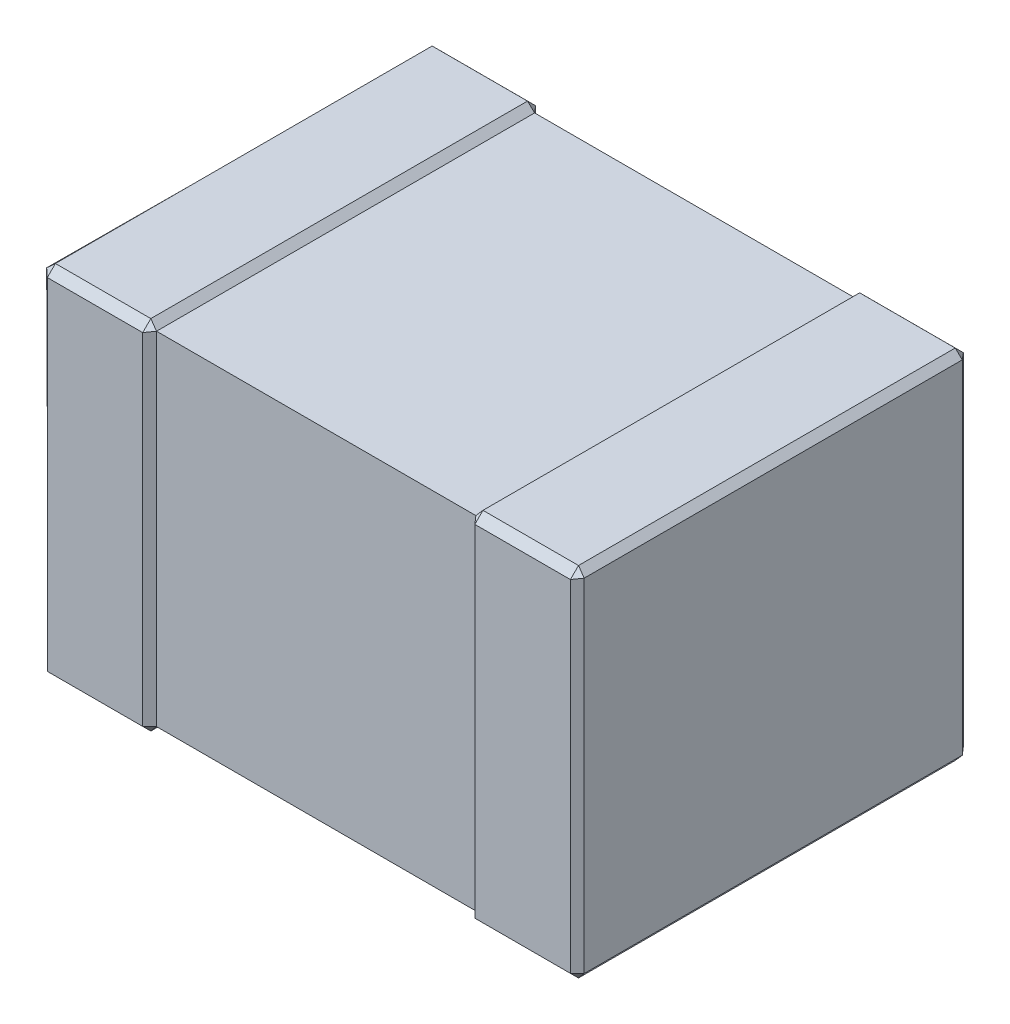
ISO-10303-21;
HEADER;
FILE_DESCRIPTION(('STEP AP214'),'2;1');
FILE_NAME('part.step','',(''),(''),'','','');
FILE_SCHEMA(('AUTOMOTIVE_DESIGN { 1 0 10303 214 1 1 1 1 }'));
ENDSEC;
DATA;
#1=APPLICATION_CONTEXT('core data for automotive mechanical design processes');
#2=APPLICATION_PROTOCOL_DEFINITION('international standard','automotive_design',2000,#1);
#3=PRODUCT_CONTEXT('',#1,'mechanical');
#4=PRODUCT('Part','Part','',(#3));
#5=PRODUCT_RELATED_PRODUCT_CATEGORY('part','',(#4));
#6=PRODUCT_DEFINITION_FORMATION('','',#4);
#7=PRODUCT_DEFINITION_CONTEXT('part definition',#1,'design');
#8=PRODUCT_DEFINITION('design','',#6,#7);
#9=PRODUCT_DEFINITION_SHAPE('','',#8);
#10=(LENGTH_UNIT() NAMED_UNIT(*) SI_UNIT(.MILLI.,.METRE.));
#11=(NAMED_UNIT(*) PLANE_ANGLE_UNIT() SI_UNIT($,.RADIAN.));
#12=(NAMED_UNIT(*) SI_UNIT($,.STERADIAN.) SOLID_ANGLE_UNIT());
#13=UNCERTAINTY_MEASURE_WITH_UNIT(LENGTH_MEASURE(1.E-05),#10,'distance_accuracy_value','');
#14=(GEOMETRIC_REPRESENTATION_CONTEXT(3) GLOBAL_UNCERTAINTY_ASSIGNED_CONTEXT((#13)) GLOBAL_UNIT_ASSIGNED_CONTEXT((#10,
#11,#12)) REPRESENTATION_CONTEXT('',''));
#15=CARTESIAN_POINT('',(0.,0.,0.));
#16=DIRECTION('',(0.,0.,1.));
#17=DIRECTION('',(1.,0.,0.));
#18=AXIS2_PLACEMENT_3D('',#15,#16,#17);
#19=CARTESIAN_POINT('',(1.912500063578,1.210036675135,2.786660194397));
#20=DIRECTION('',(-1.,0.,0.));
#21=DIRECTION('',(0.,0.,1.));
#22=AXIS2_PLACEMENT_3D('',#19,#20,#21);
#23=PLANE('',#22);
#24=CARTESIAN_POINT('',(1.912500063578,-1.210036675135,0.112191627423));
#25=DIRECTION('',(0.,1.,0.));
#26=VECTOR('',#25,1.);
#27=LINE('',#24,#26);
#28=CARTESIAN_POINT('',(1.91250006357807,-1.22210232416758,0.10006981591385));
#29=VERTEX_POINT('',#28);
#30=CARTESIAN_POINT('',(1.9125000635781,1.22210232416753,0.100069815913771));
#31=VERTEX_POINT('',#30);
#32=EDGE_CURVE('E205',#29,#31,#27,.T.);
#33=ORIENTED_EDGE('',*,*,#32,.T.);
#34=CARTESIAN_POINT('',(1.91250006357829,1.23416797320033,2.81090386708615));
#35=DIRECTION('',(0.,0.,-1.));
#36=VECTOR('',#35,1.);
#37=LINE('',#34,#36);
#38=CARTESIAN_POINT('',(1.91250006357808,1.22210232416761,2.79878203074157));
#39=VERTEX_POINT('',#38);
#40=EDGE_CURVE('E213',#39,#31,#37,.T.);
#41=ORIENTED_EDGE('',*,*,#40,.F.);
#42=CARTESIAN_POINT('',(1.912500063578,-1.2341679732,2.810903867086));
#43=DIRECTION('',(0.,1.,0.));
#44=VECTOR('',#43,1.);
#45=LINE('',#42,#44);
#46=CARTESIAN_POINT('',(1.91250006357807,-1.2221023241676,2.79878203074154));
#47=VERTEX_POINT('',#46);
#48=EDGE_CURVE('E218',#47,#39,#45,.T.);
#49=ORIENTED_EDGE('',*,*,#48,.F.);
#50=CARTESIAN_POINT('',(1.912500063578,-1.210036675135,2.786660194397));
#51=DIRECTION('',(0.,0.,-1.));
#52=VECTOR('',#51,1.);
#53=LINE('',#50,#52);
#54=EDGE_CURVE('E182',#47,#29,#53,.T.);
#55=ORIENTED_EDGE('',*,*,#54,.T.);
#56=EDGE_LOOP('',(#33,#41,#49,#55));
#57=FACE_BOUND('',#56,.T.);
#58=ADVANCED_FACE('F17',(#57),#23,.F.);
#59=CARTESIAN_POINT('',(1.878444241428,-1.264640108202,1.46938790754));
#60=DIRECTION('',(0.666808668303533,-0.745228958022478,0.));
#61=DIRECTION('',(0.745228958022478,0.666808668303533,0.));
#62=AXIS2_PLACEMENT_3D('',#59,#60,#61);
#63=PLANE('',#62);
#64=DIRECTION('',(0.,0.,1.));
#65=VECTOR('',#64,1.);
#66=CARTESIAN_POINT('',(1.86686595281,-1.275000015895,0.104939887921));
#67=LINE('',#66,#65);
#68=CARTESIAN_POINT('',(1.86686595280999,-1.27500001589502,2.79391193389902));
#69=VERTEX_POINT('',#68);
#70=CARTESIAN_POINT('',(1.86686595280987,-1.27500001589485,0.104939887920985));
#71=VERTEX_POINT('',#70);
#72=EDGE_CURVE('E186',#69,#71,#67,.F.);
#73=ORIENTED_EDGE('',*,*,#72,.T.);
#74=DIRECTION('',(-0.718095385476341,-0.642530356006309,0.267383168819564));
#75=VECTOR('',#74,1.);
#76=CARTESIAN_POINT('',(1.91250006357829,-1.23416797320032,0.0879480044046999));
#77=LINE('',#76,#75);
#78=EDGE_CURVE('E177',#29,#71,#77,.T.);
#79=ORIENTED_EDGE('',*,*,#78,.F.);
#80=ORIENTED_EDGE('',*,*,#54,.F.);
#81=DIRECTION('',(-0.718095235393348,-0.642530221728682,-0.267383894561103));
#82=VECTOR('',#81,1.);
#83=CARTESIAN_POINT('',(1.91250006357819,-1.23416797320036,2.81090386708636));
#84=LINE('',#83,#82);
#85=EDGE_CURVE('E212',#47,#69,#84,.T.);
#86=ORIENTED_EDGE('',*,*,#85,.T.);
#87=EDGE_LOOP('',(#73,#79,#80,#86));
#88=FACE_BOUND('',#87,.T.);
#89=ADVANCED_FACE('F179',(#88),#63,.T.);
#90=CARTESIAN_POINT('',(1.912500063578,1.2341679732,2.810903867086));
#91=DIRECTION('',(-0.668525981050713,0.,-0.743688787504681));
#92=DIRECTION('',(-0.743688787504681,0.,0.668525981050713));
#93=AXIS2_PLACEMENT_3D('',#90,#91,#92);
#94=PLANE('',#93);
#95=DIRECTION('',(0.,1.,0.));
#96=VECTOR('',#95,1.);
#97=CARTESIAN_POINT('',(1.86686595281,1.217254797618,2.851925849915));
#98=LINE('',#97,#96);
#99=CARTESIAN_POINT('',(1.86686595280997,1.21725479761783,2.85192584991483));
#100=VERTEX_POINT('',#99);
#101=CARTESIAN_POINT('',(1.86686595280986,-1.21725479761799,2.85192584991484));
#102=VERTEX_POINT('',#101);
#103=EDGE_CURVE('E559',#100,#102,#98,.F.);
#104=ORIENTED_EDGE('',*,*,#103,.T.);
#105=DIRECTION('',(0.716953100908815,-0.265721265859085,-0.644492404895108));
#106=VECTOR('',#105,1.);
#107=CARTESIAN_POINT('',(1.86686595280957,-1.217254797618,2.85192584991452));
#108=LINE('',#107,#106);
#109=EDGE_CURVE('E191',#102,#47,#108,.T.);
#110=ORIENTED_EDGE('',*,*,#109,.T.);
#111=ORIENTED_EDGE('',*,*,#48,.T.);
#112=DIRECTION('',(-0.716953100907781,-0.26572126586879,0.644492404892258));
#113=VECTOR('',#112,1.);
#114=CARTESIAN_POINT('',(1.91250006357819,1.23416797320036,2.81090386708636));
#115=LINE('',#114,#113);
#116=EDGE_CURVE('E542',#39,#100,#115,.T.);
#117=ORIENTED_EDGE('',*,*,#116,.T.);
#118=EDGE_LOOP('',(#104,#110,#111,#117));
#119=FACE_BOUND('',#118,.T.);
#120=ADVANCED_FACE('F239',(#119),#94,.F.);
#121=CARTESIAN_POINT('',(1.880749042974,-1.242482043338,2.819270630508));
#122=DIRECTION('',(-0.348232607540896,0.664384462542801,-0.661307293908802));
#123=DIRECTION('',(0.,0.705463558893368,0.708746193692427));
#124=AXIS2_PLACEMENT_3D('',#121,#122,#123);
#125=PLANE('',#124);
#126=DIRECTION('',(0.,-0.705463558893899,-0.708746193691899));
#127=VECTOR('',#126,1.);
#128=CARTESIAN_POINT('',(1.86686595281,-1.232554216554,2.836555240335));
#129=LINE('',#128,#127);
#130=EDGE_CURVE('E568',#69,#102,#129,.F.);
#131=ORIENTED_EDGE('',*,*,#130,.F.);
#132=ORIENTED_EDGE('',*,*,#85,.F.);
#133=ORIENTED_EDGE('',*,*,#109,.F.);
#134=EDGE_LOOP('',(#131,#132,#133));
#135=FACE_BOUND('',#134,.T.);
#136=ADVANCED_FACE('F243',(#135),#125,.F.);
#137=CARTESIAN_POINT('',(1.912500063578,1.2341679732,0.0879480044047));
#138=DIRECTION('',(-0.348233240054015,-0.664384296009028,0.661307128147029));
#139=DIRECTION('',(0.,-0.705463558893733,-0.708746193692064));
#140=AXIS2_PLACEMENT_3D('',#137,#138,#139);
#141=PLANE('',#140);
#142=DIRECTION('',(0.,-0.705463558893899,-0.708746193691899));
#143=VECTOR('',#142,1.);
#144=CARTESIAN_POINT('',(1.86686595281,1.275000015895,0.104939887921));
#145=LINE('',#144,#143);
#146=CARTESIAN_POINT('',(1.86686595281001,1.217254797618,0.0469259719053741));
#147=VERTEX_POINT('',#146);
#148=CARTESIAN_POINT('',(1.86686595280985,1.27500001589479,0.10493988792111));
#149=VERTEX_POINT('',#148);
#150=EDGE_CURVE('E573',#147,#149,#145,.F.);
#151=ORIENTED_EDGE('',*,*,#150,.T.);
#152=DIRECTION('',(-0.718095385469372,0.642530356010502,0.267383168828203));
#153=VECTOR('',#152,1.);
#154=CARTESIAN_POINT('',(1.912500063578,1.2341679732,0.0879480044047));
#155=LINE('',#154,#153);
#156=EDGE_CURVE('E538',#31,#149,#155,.T.);
#157=ORIENTED_EDGE('',*,*,#156,.F.);
#158=DIRECTION('',(0.716952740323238,0.265721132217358,0.644492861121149));
#159=VECTOR('',#158,1.);
#160=CARTESIAN_POINT('',(1.86686595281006,1.217254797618,0.046925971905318));
#161=LINE('',#160,#159);
#162=EDGE_CURVE('E200',#147,#31,#161,.T.);
#163=ORIENTED_EDGE('',*,*,#162,.F.);
#164=EDGE_LOOP('',(#151,#157,#163));
#165=FACE_BOUND('',#164,.T.);
#166=ADVANCED_FACE('F270',(#165),#141,.F.);
#167=CARTESIAN_POINT('',(1.878444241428,1.264640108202,1.46938790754));
#168=DIRECTION('',(-0.666808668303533,-0.745228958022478,0.));
#169=DIRECTION('',(0.745228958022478,-0.666808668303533,0.));
#170=AXIS2_PLACEMENT_3D('',#167,#168,#169);
#171=PLANE('',#170);
#172=DIRECTION('',(0.,0.,-1.));
#173=VECTOR('',#172,1.);
#174=CARTESIAN_POINT('',(1.86686595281,1.275000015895,0.104939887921));
#175=LINE('',#174,#173);
#176=CARTESIAN_POINT('',(1.86686595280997,1.27500001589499,2.79391193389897));
#177=VERTEX_POINT('',#176);
#178=EDGE_CURVE('E580',#149,#177,#175,.F.);
#179=ORIENTED_EDGE('',*,*,#178,.T.);
#180=DIRECTION('',(0.718095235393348,-0.642530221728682,0.267383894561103));
#181=VECTOR('',#180,1.);
#182=CARTESIAN_POINT('',(1.86686595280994,1.27500001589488,2.79391193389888));
#183=LINE('',#182,#181);
#184=EDGE_CURVE('E201',#177,#39,#183,.T.);
#185=ORIENTED_EDGE('',*,*,#184,.T.);
#186=ORIENTED_EDGE('',*,*,#40,.T.);
#187=ORIENTED_EDGE('',*,*,#156,.T.);
#188=EDGE_LOOP('',(#179,#185,#186,#187));
#189=FACE_BOUND('',#188,.T.);
#190=ADVANCED_FACE('F260',(#189),#171,.F.);
#191=CARTESIAN_POINT('',(1.880749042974,1.242482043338,2.819270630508));
#192=DIRECTION('',(-0.348232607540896,-0.664384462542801,-0.661307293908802));
#193=DIRECTION('',(0.,0.705463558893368,-0.708746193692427));
#194=AXIS2_PLACEMENT_3D('',#191,#192,#193);
#195=PLANE('',#194);
#196=DIRECTION('',(0.,0.705463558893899,-0.708746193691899));
#197=VECTOR('',#196,1.);
#198=CARTESIAN_POINT('',(1.86686595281,1.275000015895,2.793911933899));
#199=LINE('',#198,#197);
#200=EDGE_CURVE('E583',#177,#100,#199,.F.);
#201=ORIENTED_EDGE('',*,*,#200,.T.);
#202=ORIENTED_EDGE('',*,*,#116,.F.);
#203=ORIENTED_EDGE('',*,*,#184,.F.);
#204=EDGE_LOOP('',(#201,#202,#203));
#205=FACE_BOUND('',#204,.T.);
#206=ADVANCED_FACE('F269',(#205),#195,.F.);
#207=CARTESIAN_POINT('',(1.912500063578,-1.2341679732,0.0879480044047));
#208=DIRECTION('',(-0.348233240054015,0.664384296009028,0.661307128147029));
#209=DIRECTION('',(0.,-0.705463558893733,0.708746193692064));
#210=AXIS2_PLACEMENT_3D('',#207,#208,#209);
#211=PLANE('',#210);
#212=DIRECTION('',(0.,0.705463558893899,-0.708746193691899));
#213=VECTOR('',#212,1.);
#214=CARTESIAN_POINT('',(1.86686595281,-1.232554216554,0.0622965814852));
#215=LINE('',#214,#213);
#216=CARTESIAN_POINT('',(1.86686595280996,-1.2172547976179,0.0469259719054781));
#217=VERTEX_POINT('',#216);
#218=EDGE_CURVE('E196',#217,#71,#215,.F.);
#219=ORIENTED_EDGE('',*,*,#218,.F.);
#220=DIRECTION('',(-0.716952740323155,0.265721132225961,-0.644492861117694));
#221=VECTOR('',#220,1.);
#222=CARTESIAN_POINT('',(1.912500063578,-1.2341679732,0.0879480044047));
#223=LINE('',#222,#221);
#224=EDGE_CURVE('E193',#29,#217,#223,.T.);
#225=ORIENTED_EDGE('',*,*,#224,.F.);
#226=ORIENTED_EDGE('',*,*,#78,.T.);
#227=EDGE_LOOP('',(#219,#225,#226));
#228=FACE_BOUND('',#227,.T.);
#229=ADVANCED_FACE('F195',(#228),#211,.F.);
#230=CARTESIAN_POINT('',(1.878461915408,0.01994885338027,0.05734997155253));
#231=DIRECTION('',(0.66852642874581,0.,-0.743688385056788));
#232=DIRECTION('',(-0.743688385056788,0.,-0.66852642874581));
#233=AXIS2_PLACEMENT_3D('',#230,#231,#232);
#234=PLANE('',#233);
#235=DIRECTION('',(0.,1.,0.));
#236=VECTOR('',#235,1.);
#237=CARTESIAN_POINT('',(1.86686595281,-1.217254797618,0.04692597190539));
#238=LINE('',#237,#236);
#239=EDGE_CURVE('E602',#217,#147,#238,.T.);
#240=ORIENTED_EDGE('',*,*,#239,.T.);
#241=ORIENTED_EDGE('',*,*,#162,.T.);
#242=ORIENTED_EDGE('',*,*,#32,.F.);
#243=ORIENTED_EDGE('',*,*,#224,.T.);
#244=EDGE_LOOP('',(#240,#241,#242,#243));
#245=FACE_BOUND('',#244,.T.);
#246=ADVANCED_FACE('F207',(#245),#234,.T.);
#247=CARTESIAN_POINT('',(1.184772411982,1.275000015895,2.793911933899));
#248=DIRECTION('',(0.,-0.708746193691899,-0.705463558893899));
#249=DIRECTION('',(0.,0.705463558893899,-0.708746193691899));
#250=AXIS2_PLACEMENT_3D('',#247,#248,#249);
#251=PLANE('',#250);
#252=DIRECTION('',(1.,0.,0.));
#253=VECTOR('',#252,1.);
#254=CARTESIAN_POINT('',(1.184772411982,1.2172547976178,2.8519258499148));
#255=LINE('',#254,#253);
#256=CARTESIAN_POINT('',(1.18477241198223,1.21725479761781,2.85192584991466));
#257=VERTEX_POINT('',#256);
#258=EDGE_CURVE('E592',#100,#257,#255,.F.);
#259=ORIENTED_EDGE('',*,*,#258,.F.);
#260=ORIENTED_EDGE('',*,*,#200,.F.);
#261=DIRECTION('',(1.,0.,0.));
#262=VECTOR('',#261,1.);
#263=CARTESIAN_POINT('',(1.184772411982,1.275000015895,2.793911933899));
#264=LINE('',#263,#262);
#265=CARTESIAN_POINT('',(1.18477241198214,1.2750000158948,2.79391193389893));
#266=VERTEX_POINT('',#265);
#267=EDGE_CURVE('E613',#177,#266,#264,.F.);
#268=ORIENTED_EDGE('',*,*,#267,.T.);
#269=DIRECTION('',(0.,-0.705463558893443,0.708746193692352));
#270=VECTOR('',#269,1.);
#271=CARTESIAN_POINT('',(1.18477241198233,1.24613729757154,2.82290895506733));
#272=LINE('',#271,#270);
#273=EDGE_CURVE('E618',#257,#266,#272,.F.);
#274=ORIENTED_EDGE('',*,*,#273,.F.);
#275=EDGE_LOOP('',(#259,#260,#268,#274));
#276=FACE_BOUND('',#275,.T.);
#277=ADVANCED_FACE('F753',(#276),#251,.F.);
#278=CARTESIAN_POINT('',(1.86686595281,-1.275000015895,0.104939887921));
#279=DIRECTION('',(0.,1.,0.));
#280=DIRECTION('',(0.,0.,1.));
#281=AXIS2_PLACEMENT_3D('',#278,#279,#280);
#282=PLANE('',#281);
#283=DIRECTION('',(0.,0.,1.));
#284=VECTOR('',#283,1.);
#285=CARTESIAN_POINT('',(1.18477241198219,-1.27500001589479,1.469387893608));
#286=LINE('',#285,#284);
#287=CARTESIAN_POINT('',(1.18477241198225,-1.27500001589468,0.104939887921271));
#288=VERTEX_POINT('',#287);
#289=CARTESIAN_POINT('',(1.18477241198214,-1.27500001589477,2.79391193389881));
#290=VERTEX_POINT('',#289);
#291=EDGE_CURVE('E631',#288,#290,#286,.T.);
#292=ORIENTED_EDGE('',*,*,#291,.F.);
#293=DIRECTION('',(1.,0.,0.));
#294=VECTOR('',#293,1.);
#295=CARTESIAN_POINT('',(1.506579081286,-1.27500001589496,0.104939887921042));
#296=LINE('',#295,#294);
#297=EDGE_CURVE('E622',#71,#288,#296,.F.);
#298=ORIENTED_EDGE('',*,*,#297,.F.);
#299=ORIENTED_EDGE('',*,*,#72,.F.);
#300=DIRECTION('',(1.,0.,0.));
#301=VECTOR('',#300,1.);
#302=CARTESIAN_POINT('',(1.86686595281,-1.275000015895,2.793911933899));
#303=LINE('',#302,#301);
#304=EDGE_CURVE('E555',#290,#69,#303,.T.);
#305=ORIENTED_EDGE('',*,*,#304,.F.);
#306=EDGE_LOOP('',(#292,#298,#299,#305));
#307=FACE_BOUND('',#306,.T.);
#308=ADVANCED_FACE('F749',(#307),#282,.F.);
#309=CARTESIAN_POINT('',(1.506579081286,-1.259700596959,2.809282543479));
#310=DIRECTION('',(0.,0.708746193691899,-0.705463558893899));
#311=DIRECTION('',(0.,0.705463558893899,0.708746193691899));
#312=AXIS2_PLACEMENT_3D('',#309,#310,#311);
#313=PLANE('',#312);
#314=ORIENTED_EDGE('',*,*,#304,.T.);
#315=ORIENTED_EDGE('',*,*,#130,.T.);
#316=DIRECTION('',(-1.,0.,0.));
#317=VECTOR('',#316,1.);
#318=CARTESIAN_POINT('',(1.184772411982,-1.217254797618,2.851925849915));
#319=LINE('',#318,#317);
#320=CARTESIAN_POINT('',(1.18477241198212,-1.21725479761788,2.85192584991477));
#321=VERTEX_POINT('',#320);
#322=EDGE_CURVE('E604',#102,#321,#319,.T.);
#323=ORIENTED_EDGE('',*,*,#322,.T.);
#324=DIRECTION('',(0.,-0.705463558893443,-0.708746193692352));
#325=VECTOR('',#324,1.);
#326=CARTESIAN_POINT('',(1.18477241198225,-1.24613729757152,2.82290895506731));
#327=LINE('',#326,#325);
#328=EDGE_CURVE('E639',#290,#321,#327,.F.);
#329=ORIENTED_EDGE('',*,*,#328,.F.);
#330=EDGE_LOOP('',(#314,#315,#323,#329));
#331=FACE_BOUND('',#330,.T.);
#332=ADVANCED_FACE('F745',(#331),#313,.F.);
#333=CARTESIAN_POINT('',(1.184772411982,1.217254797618,2.851925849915));
#334=DIRECTION('',(0.,0.,-1.));
#335=DIRECTION('',(-1.,0.,0.));
#336=AXIS2_PLACEMENT_3D('',#333,#334,#335);
#337=PLANE('',#336);
#338=ORIENTED_EDGE('',*,*,#322,.F.);
#339=ORIENTED_EDGE('',*,*,#103,.F.);
#340=ORIENTED_EDGE('',*,*,#258,.T.);
#341=DIRECTION('',(0.,1.,0.));
#342=VECTOR('',#341,1.);
#343=CARTESIAN_POINT('',(1.18477241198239,0.01994883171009,2.85192584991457));
#344=LINE('',#343,#342);
#345=EDGE_CURVE('E648',#257,#321,#344,.F.);
#346=ORIENTED_EDGE('',*,*,#345,.T.);
#347=EDGE_LOOP('',(#338,#339,#340,#346));
#348=FACE_BOUND('',#347,.T.);
#349=ADVANCED_FACE('F741',(#348),#337,.F.);
#350=CARTESIAN_POINT('',(1.506579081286,1.232554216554,0.0622965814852));
#351=DIRECTION('',(0.,0.708746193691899,-0.705463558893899));
#352=DIRECTION('',(0.,0.705463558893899,0.708746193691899));
#353=AXIS2_PLACEMENT_3D('',#350,#351,#352);
#354=PLANE('',#353);
#355=DIRECTION('',(1.,0.,0.));
#356=VECTOR('',#355,1.);
#357=CARTESIAN_POINT('',(1.184772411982,1.217254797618,0.04692597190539));
#358=LINE('',#357,#356);
#359=CARTESIAN_POINT('',(1.1847724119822,1.21725479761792,0.0469259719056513));
#360=VERTEX_POINT('',#359);
#361=EDGE_CURVE('E626',#147,#360,#358,.F.);
#362=ORIENTED_EDGE('',*,*,#361,.T.);
#363=DIRECTION('',(0.,-0.705463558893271,-0.708746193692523));
#364=VECTOR('',#363,1.);
#365=CARTESIAN_POINT('',(1.18477241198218,1.24618292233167,0.0759887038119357));
#366=LINE('',#365,#364);
#367=CARTESIAN_POINT('',(1.18477241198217,1.27500001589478,0.104939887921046));
#368=VERTEX_POINT('',#367);
#369=EDGE_CURVE('E651',#360,#368,#366,.F.);
#370=ORIENTED_EDGE('',*,*,#369,.T.);
#371=DIRECTION('',(1.,0.,0.));
#372=VECTOR('',#371,1.);
#373=CARTESIAN_POINT('',(1.184772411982,1.275000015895,0.104939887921));
#374=LINE('',#373,#372);
#375=EDGE_CURVE('E577',#368,#149,#374,.T.);
#376=ORIENTED_EDGE('',*,*,#375,.T.);
#377=ORIENTED_EDGE('',*,*,#150,.F.);
#378=EDGE_LOOP('',(#362,#370,#376,#377));
#379=FACE_BOUND('',#378,.T.);
#380=ADVANCED_FACE('F737',(#379),#354,.T.);
#381=CARTESIAN_POINT('',(1.184772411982,1.275000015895,0.104939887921));
#382=DIRECTION('',(0.,-1.,0.));
#383=DIRECTION('',(0.,0.,-1.));
#384=AXIS2_PLACEMENT_3D('',#381,#382,#383);
#385=PLANE('',#384);
#386=ORIENTED_EDGE('',*,*,#267,.F.);
#387=ORIENTED_EDGE('',*,*,#178,.F.);
#388=ORIENTED_EDGE('',*,*,#375,.F.);
#389=DIRECTION('',(0.,0.,1.));
#390=VECTOR('',#389,1.);
#391=CARTESIAN_POINT('',(1.18477241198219,1.27500001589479,1.469387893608));
#392=LINE('',#391,#390);
#393=EDGE_CURVE('E660',#368,#266,#392,.T.);
#394=ORIENTED_EDGE('',*,*,#393,.T.);
#395=EDGE_LOOP('',(#386,#387,#388,#394));
#396=FACE_BOUND('',#395,.T.);
#397=ADVANCED_FACE('F733',(#396),#385,.F.);
#398=CARTESIAN_POINT('',(1.17088935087,1.242482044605,2.819270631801));
#399=DIRECTION('',(-0.348233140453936,0.664384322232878,0.661307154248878));
#400=DIRECTION('',(0.,-0.705463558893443,0.708746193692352));
#401=AXIS2_PLACEMENT_3D('',#398,#399,#400);
#402=PLANE('',#401);
#403=ORIENTED_EDGE('',*,*,#273,.T.);
#404=DIRECTION('',(-0.718094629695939,-0.64253079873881,0.267384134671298));
#405=VECTOR('',#404,1.);
#406=CARTESIAN_POINT('',(1.18477241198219,1.27500001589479,2.793911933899));
#407=LINE('',#406,#405);
#408=CARTESIAN_POINT('',(1.13913838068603,1.22210232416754,2.79878203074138));
#409=VERTEX_POINT('',#408);
#410=EDGE_CURVE('E665',#266,#409,#407,.T.);
#411=ORIENTED_EDGE('',*,*,#410,.T.);
#412=DIRECTION('',(0.716952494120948,-0.265721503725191,0.644492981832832));
#413=VECTOR('',#412,1.);
#414=CARTESIAN_POINT('',(1.13913838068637,1.2341679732,2.81090386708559));
#415=LINE('',#414,#413);
#416=EDGE_CURVE('E641',#409,#257,#415,.T.);
#417=ORIENTED_EDGE('',*,*,#416,.T.);
#418=EDGE_LOOP('',(#403,#411,#417));
#419=FACE_BOUND('',#418,.T.);
#420=ADVANCED_FACE('F729',(#419),#402,.T.);
#421=CARTESIAN_POINT('',(1.506579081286,-1.259700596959,0.08956927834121));
#422=DIRECTION('',(0.,-0.708746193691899,-0.705463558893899));
#423=DIRECTION('',(0.,0.705463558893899,-0.708746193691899));
#424=AXIS2_PLACEMENT_3D('',#421,#422,#423);
#425=PLANE('',#424);
#426=ORIENTED_EDGE('',*,*,#297,.T.);
#427=DIRECTION('',(0.,-0.705463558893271,0.708746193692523));
#428=VECTOR('',#427,1.);
#429=CARTESIAN_POINT('',(1.1847724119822,-1.24618292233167,0.0759887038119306));
#430=LINE('',#429,#428);
#431=CARTESIAN_POINT('',(1.18477241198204,-1.21725479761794,0.0469259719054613));
#432=VERTEX_POINT('',#431);
#433=EDGE_CURVE('E670',#288,#432,#430,.F.);
#434=ORIENTED_EDGE('',*,*,#433,.T.);
#435=DIRECTION('',(1.,0.,0.));
#436=VECTOR('',#435,1.);
#437=CARTESIAN_POINT('',(1.184772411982,-1.217254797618,0.04692597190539));
#438=LINE('',#437,#436);
#439=EDGE_CURVE('E599',#432,#217,#438,.T.);
#440=ORIENTED_EDGE('',*,*,#439,.T.);
#441=ORIENTED_EDGE('',*,*,#218,.T.);
#442=EDGE_LOOP('',(#426,#434,#440,#441));
#443=FACE_BOUND('',#442,.T.);
#444=ADVANCED_FACE('F725',(#443),#425,.T.);
#445=CARTESIAN_POINT('',(1.184772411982,-1.217254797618,0.04692597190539));
#446=DIRECTION('',(0.,0.,1.));
#447=DIRECTION('',(1.,0.,0.));
#448=AXIS2_PLACEMENT_3D('',#445,#446,#447);
#449=PLANE('',#448);
#450=ORIENTED_EDGE('',*,*,#361,.F.);
#451=ORIENTED_EDGE('',*,*,#239,.F.);
#452=ORIENTED_EDGE('',*,*,#439,.F.);
#453=DIRECTION('',(0.,1.,0.));
#454=VECTOR('',#453,1.);
#455=CARTESIAN_POINT('',(1.18477241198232,0.01994883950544,0.0469259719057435));
#456=LINE('',#455,#454);
#457=EDGE_CURVE('E675',#432,#360,#456,.T.);
#458=ORIENTED_EDGE('',*,*,#457,.T.);
#459=EDGE_LOOP('',(#450,#451,#452,#458));
#460=FACE_BOUND('',#459,.T.);
#461=ADVANCED_FACE('F721',(#460),#449,.F.);
#462=CARTESIAN_POINT('',(1.17088935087,-1.242482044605,2.819270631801));
#463=DIRECTION('',(-0.348233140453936,-0.664384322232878,0.661307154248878));
#464=DIRECTION('',(0.,-0.705463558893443,-0.708746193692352));
#465=AXIS2_PLACEMENT_3D('',#462,#463,#464);
#466=PLANE('',#465);
#467=ORIENTED_EDGE('',*,*,#328,.T.);
#468=DIRECTION('',(0.716952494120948,0.265721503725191,0.644492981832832));
#469=VECTOR('',#468,1.);
#470=CARTESIAN_POINT('',(1.13913838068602,-1.2341679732,2.81090386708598));
#471=LINE('',#470,#469);
#472=CARTESIAN_POINT('',(1.13913838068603,-1.22210232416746,2.79878203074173));
#473=VERTEX_POINT('',#472);
#474=EDGE_CURVE('E690',#473,#321,#471,.T.);
#475=ORIENTED_EDGE('',*,*,#474,.F.);
#476=DIRECTION('',(0.718094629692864,-0.642530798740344,-0.267384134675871));
#477=VECTOR('',#476,1.);
#478=CARTESIAN_POINT('',(1.1391383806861,-1.23416797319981,2.81090386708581));
#479=LINE('',#478,#477);
#480=EDGE_CURVE('E636',#473,#290,#479,.T.);
#481=ORIENTED_EDGE('',*,*,#480,.T.);
#482=EDGE_LOOP('',(#467,#475,#481));
#483=FACE_BOUND('',#482,.T.);
#484=ADVANCED_FACE('F717',(#483),#466,.T.);
#485=CARTESIAN_POINT('',(1.139138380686,1.2341679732,0.0879480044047));
#486=DIRECTION('',(0.348233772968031,-0.664384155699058,0.661306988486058));
#487=DIRECTION('',(0.,-0.705463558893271,-0.708746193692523));
#488=AXIS2_PLACEMENT_3D('',#485,#486,#487);
#489=PLANE('',#488);
#490=ORIENTED_EDGE('',*,*,#369,.F.);
#491=DIRECTION('',(-0.71695213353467,0.265721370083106,0.644493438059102));
#492=VECTOR('',#491,1.);
#493=CARTESIAN_POINT('',(1.18477241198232,1.217254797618,0.0469259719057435));
#494=LINE('',#493,#492);
#495=CARTESIAN_POINT('',(1.13913838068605,1.2221023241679,0.100069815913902));
#496=VERTEX_POINT('',#495);
#497=EDGE_CURVE('E680',#360,#496,#494,.T.);
#498=ORIENTED_EDGE('',*,*,#497,.T.);
#499=DIRECTION('',(0.718094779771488,0.642530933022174,0.267383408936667));
#500=VECTOR('',#499,1.);
#501=CARTESIAN_POINT('',(1.13913838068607,1.23416797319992,0.0879480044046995));
#502=LINE('',#501,#500);
#503=EDGE_CURVE('E791',#496,#368,#502,.T.);
#504=ORIENTED_EDGE('',*,*,#503,.T.);
#505=EDGE_LOOP('',(#490,#498,#504));
#506=FACE_BOUND('',#505,.T.);
#507=ADVANCED_FACE('F713',(#506),#489,.F.);
#508=CARTESIAN_POINT('',(1.139138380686,-1.2341679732,0.0879480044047));
#509=DIRECTION('',(0.348233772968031,0.664384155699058,0.661306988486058));
#510=DIRECTION('',(0.,-0.705463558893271,0.708746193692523));
#511=AXIS2_PLACEMENT_3D('',#508,#509,#510);
#512=PLANE('',#511);
#513=ORIENTED_EDGE('',*,*,#433,.F.);
#514=DIRECTION('',(-0.718094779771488,0.642530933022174,-0.267383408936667));
#515=VECTOR('',#514,1.);
#516=CARTESIAN_POINT('',(1.18477241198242,-1.27500001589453,0.104939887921));
#517=LINE('',#516,#515);
#518=CARTESIAN_POINT('',(1.13913838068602,-1.22210232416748,0.100069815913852));
#519=VERTEX_POINT('',#518);
#520=EDGE_CURVE('E685',#288,#519,#517,.T.);
#521=ORIENTED_EDGE('',*,*,#520,.T.);
#522=DIRECTION('',(0.71695213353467,0.265721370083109,-0.644493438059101));
#523=VECTOR('',#522,1.);
#524=CARTESIAN_POINT('',(1.139138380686,-1.2341679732,0.0879480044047));
#525=LINE('',#524,#523);
#526=EDGE_CURVE('E789',#519,#432,#525,.T.);
#527=ORIENTED_EDGE('',*,*,#526,.T.);
#528=EDGE_LOOP('',(#513,#521,#527));
#529=FACE_BOUND('',#528,.T.);
#530=ADVANCED_FACE('F708',(#529),#512,.F.);
#531=CARTESIAN_POINT('',(1.150645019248,-1.244463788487,1.437959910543));
#532=DIRECTION('',(0.666809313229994,0.745228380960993,0.));
#533=DIRECTION('',(-0.745228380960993,0.666809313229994,0.));
#534=AXIS2_PLACEMENT_3D('',#531,#532,#533);
#535=PLANE('',#534);
#536=ORIENTED_EDGE('',*,*,#520,.F.);
#537=ORIENTED_EDGE('',*,*,#291,.T.);
#538=ORIENTED_EDGE('',*,*,#480,.F.);
#539=CARTESIAN_POINT('',(1.13913838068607,-1.23416797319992,2.81090386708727));
#540=DIRECTION('',(0.,0.,-1.));
#541=VECTOR('',#540,1.);
#542=LINE('',#539,#541);
#543=EDGE_CURVE('E785',#473,#519,#542,.T.);
#544=ORIENTED_EDGE('',*,*,#543,.T.);
#545=EDGE_LOOP('',(#536,#537,#538,#544));
#546=FACE_BOUND('',#545,.T.);
#547=ADVANCED_FACE('F697',(#546),#535,.F.);
#548=CARTESIAN_POINT('',(1.150655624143,-0.01149224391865,2.821257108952));
#549=DIRECTION('',(-0.668526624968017,0.,0.743688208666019));
#550=DIRECTION('',(0.743688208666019,0.,0.668526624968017));
#551=AXIS2_PLACEMENT_3D('',#548,#549,#550);
#552=PLANE('',#551);
#553=ORIENTED_EDGE('',*,*,#474,.T.);
#554=ORIENTED_EDGE('',*,*,#345,.F.);
#555=ORIENTED_EDGE('',*,*,#416,.F.);
#556=CARTESIAN_POINT('',(1.13913838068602,1.23416797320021,2.81090386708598));
#557=DIRECTION('',(0.,-1.,0.));
#558=VECTOR('',#557,1.);
#559=LINE('',#556,#558);
#560=EDGE_CURVE('E437',#409,#473,#559,.T.);
#561=ORIENTED_EDGE('',*,*,#560,.T.);
#562=EDGE_LOOP('',(#553,#554,#555,#561));
#563=FACE_BOUND('',#562,.T.);
#564=ADVANCED_FACE('F707',(#563),#552,.T.);
#565=CARTESIAN_POINT('',(1.150645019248,1.244463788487,1.437959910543));
#566=DIRECTION('',(0.666809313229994,-0.745228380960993,0.));
#567=DIRECTION('',(0.745228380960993,0.666809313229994,0.));
#568=AXIS2_PLACEMENT_3D('',#565,#566,#567);
#569=PLANE('',#568);
#570=ORIENTED_EDGE('',*,*,#503,.F.);
#571=CARTESIAN_POINT('',(1.13913838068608,1.23416797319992,0.0879480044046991));
#572=DIRECTION('',(0.,0.,1.));
#573=VECTOR('',#572,1.);
#574=LINE('',#571,#573);
#575=EDGE_CURVE('E451',#496,#409,#574,.T.);
#576=ORIENTED_EDGE('',*,*,#575,.T.);
#577=ORIENTED_EDGE('',*,*,#410,.F.);
#578=ORIENTED_EDGE('',*,*,#393,.F.);
#579=EDGE_LOOP('',(#570,#576,#577,#578));
#580=FACE_BOUND('',#579,.T.);
#581=ADVANCED_FACE('F809',(#580),#569,.F.);
#582=CARTESIAN_POINT('',(1.139138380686,1.2341679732,0.0879480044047));
#583=DIRECTION('',(0.668527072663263,0.,0.743687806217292));
#584=DIRECTION('',(0.743687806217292,0.,-0.668527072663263));
#585=AXIS2_PLACEMENT_3D('',#582,#583,#584);
#586=PLANE('',#585);
#587=ORIENTED_EDGE('',*,*,#526,.F.);
#588=CARTESIAN_POINT('',(1.13913838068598,-1.2341679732,0.0879480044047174));
#589=DIRECTION('',(0.,1.,0.));
#590=VECTOR('',#589,1.);
#591=LINE('',#588,#590);
#592=EDGE_CURVE('E400',#519,#496,#591,.T.);
#593=ORIENTED_EDGE('',*,*,#592,.T.);
#594=ORIENTED_EDGE('',*,*,#497,.F.);
#595=ORIENTED_EDGE('',*,*,#457,.F.);
#596=EDGE_LOOP('',(#587,#593,#594,#595));
#597=FACE_BOUND('',#596,.T.);
#598=ADVANCED_FACE('F463',(#597),#586,.F.);
#599=CARTESIAN_POINT('',(1.139138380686,1.210036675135,2.786660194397));
#600=DIRECTION('',(0.,-1.,0.));
#601=DIRECTION('',(0.,0.,-1.));
#602=AXIS2_PLACEMENT_3D('',#599,#600,#601);
#603=PLANE('',#602);
#604=CARTESIAN_POINT('',(-1.11335576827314,1.210036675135,0.100069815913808));
#605=DIRECTION('',(0.,0.,1.));
#606=VECTOR('',#605,1.);
#607=LINE('',#604,#606);
#608=CARTESIAN_POINT('',(-1.1403249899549,1.22210232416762,0.100069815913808));
#609=VERTEX_POINT('',#608);
#610=CARTESIAN_POINT('',(-1.14032498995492,1.22210232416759,2.79878203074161));
#611=VERTEX_POINT('',#610);
#612=EDGE_CURVE('E477',#609,#611,#607,.T.);
#613=ORIENTED_EDGE('',*,*,#612,.T.);
#614=DIRECTION('',(-1.,0.,0.));
#615=VECTOR('',#614,1.);
#616=CARTESIAN_POINT('',(1.139138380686,1.210036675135,2.786660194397));
#617=LINE('',#616,#615);
#618=EDGE_CURVE('E845',#611,#409,#617,.F.);
#619=ORIENTED_EDGE('',*,*,#618,.T.);
#620=ORIENTED_EDGE('',*,*,#575,.F.);
#621=DIRECTION('',(1.,0.,0.));
#622=VECTOR('',#621,1.);
#623=CARTESIAN_POINT('',(1.139138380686,1.210036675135,0.112191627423));
#624=LINE('',#623,#622);
#625=EDGE_CURVE('E844',#496,#609,#624,.F.);
#626=ORIENTED_EDGE('',*,*,#625,.T.);
#627=EDGE_LOOP('',(#613,#619,#620,#626));
#628=FACE_BOUND('',#627,.T.);
#629=ADVANCED_FACE('F454',(#628),#603,.F.);
#630=CARTESIAN_POINT('',(1.139138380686,1.210036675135,2.786660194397));
#631=DIRECTION('',(0.,0.,-1.));
#632=DIRECTION('',(-1.,0.,0.));
#633=AXIS2_PLACEMENT_3D('',#630,#631,#632);
#634=PLANE('',#633);
#635=DIRECTION('',(0.,-1.,0.));
#636=VECTOR('',#635,1.);
#637=CARTESIAN_POINT('',(-1.1133556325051,-0.01149224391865,2.786660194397));
#638=LINE('',#637,#636);
#639=CARTESIAN_POINT('',(-1.1403249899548,-1.2221023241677,2.7987820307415));
#640=VERTEX_POINT('',#639);
#641=EDGE_CURVE('E481',#611,#640,#638,.T.);
#642=ORIENTED_EDGE('',*,*,#641,.T.);
#643=DIRECTION('',(1.,0.,0.));
#644=VECTOR('',#643,1.);
#645=CARTESIAN_POINT('',(1.139138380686,-1.210036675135,2.786660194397));
#646=LINE('',#645,#644);
#647=EDGE_CURVE('E786',#640,#473,#646,.T.);
#648=ORIENTED_EDGE('',*,*,#647,.T.);
#649=ORIENTED_EDGE('',*,*,#560,.F.);
#650=ORIENTED_EDGE('',*,*,#618,.F.);
#651=EDGE_LOOP('',(#642,#648,#649,#650));
#652=FACE_BOUND('',#651,.T.);
#653=ADVANCED_FACE('F420',(#652),#634,.F.);
#654=CARTESIAN_POINT('',(1.139138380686,-1.210036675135,2.786660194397));
#655=DIRECTION('',(0.,1.,0.));
#656=DIRECTION('',(0.,0.,1.));
#657=AXIS2_PLACEMENT_3D('',#654,#655,#656);
#658=PLANE('',#657);
#659=DIRECTION('',(0.,0.,-1.));
#660=VECTOR('',#659,1.);
#661=CARTESIAN_POINT('',(-1.11335576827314,-1.210036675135,1.437959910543));
#662=LINE('',#661,#660);
#663=CARTESIAN_POINT('',(-1.14032498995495,-1.22210232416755,0.10006981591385));
#664=VERTEX_POINT('',#663);
#665=EDGE_CURVE('E484',#640,#664,#662,.T.);
#666=ORIENTED_EDGE('',*,*,#665,.T.);
#667=DIRECTION('',(1.,0.,0.));
#668=VECTOR('',#667,1.);
#669=CARTESIAN_POINT('',(1.139138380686,-1.210036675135,0.112191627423));
#670=LINE('',#669,#668);
#671=EDGE_CURVE('E788',#664,#519,#670,.T.);
#672=ORIENTED_EDGE('',*,*,#671,.T.);
#673=ORIENTED_EDGE('',*,*,#543,.F.);
#674=ORIENTED_EDGE('',*,*,#647,.F.);
#675=EDGE_LOOP('',(#666,#672,#673,#674));
#676=FACE_BOUND('',#675,.T.);
#677=ADVANCED_FACE('F416',(#676),#658,.F.);
#678=CARTESIAN_POINT('',(1.139138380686,1.210036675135,0.112191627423));
#679=DIRECTION('',(0.,0.,1.));
#680=DIRECTION('',(1.,0.,0.));
#681=AXIS2_PLACEMENT_3D('',#678,#679,#680);
#682=PLANE('',#681);
#683=DIRECTION('',(0.,1.,0.));
#684=VECTOR('',#683,1.);
#685=CARTESIAN_POINT('',(-1.11335572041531,1.2341679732,0.112191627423));
#686=LINE('',#685,#684);
#687=EDGE_CURVE('E492',#664,#609,#686,.T.);
#688=ORIENTED_EDGE('',*,*,#687,.T.);
#689=ORIENTED_EDGE('',*,*,#625,.F.);
#690=ORIENTED_EDGE('',*,*,#592,.F.);
#691=ORIENTED_EDGE('',*,*,#671,.F.);
#692=EDGE_LOOP('',(#688,#689,#690,#691));
#693=FACE_BOUND('',#692,.T.);
#694=ADVANCED_FACE('F407',(#693),#682,.F.);
#695=CARTESIAN_POINT('',(-1.172075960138,-1.242482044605,2.819270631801));
#696=DIRECTION('',(0.348233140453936,-0.664384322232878,0.661307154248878));
#697=DIRECTION('',(0.,-0.705463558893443,-0.708746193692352));
#698=AXIS2_PLACEMENT_3D('',#695,#696,#697);
#699=PLANE('',#698);
#700=DIRECTION('',(0.,0.705463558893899,0.708746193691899));
#701=VECTOR('',#700,1.);
#702=CARTESIAN_POINT('',(-1.18595902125,-1.275000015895,2.793911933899));
#703=LINE('',#702,#701);
#704=CARTESIAN_POINT('',(-1.18595902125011,-1.2172547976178,2.85192584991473));
#705=VERTEX_POINT('',#704);
#706=CARTESIAN_POINT('',(-1.18595902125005,-1.27500001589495,2.793911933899));
#707=VERTEX_POINT('',#706);
#708=EDGE_CURVE('E883',#705,#707,#703,.F.);
#709=ORIENTED_EDGE('',*,*,#708,.T.);
#710=DIRECTION('',(0.718094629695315,0.642530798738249,0.267384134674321));
#711=VECTOR('',#710,1.);
#712=CARTESIAN_POINT('',(-1.18595902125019,-1.27500001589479,2.793911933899));
#713=LINE('',#712,#711);
#714=EDGE_CURVE('E888',#707,#640,#713,.T.);
#715=ORIENTED_EDGE('',*,*,#714,.T.);
#716=DIRECTION('',(-0.716952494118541,0.265721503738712,0.644492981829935));
#717=VECTOR('',#716,1.);
#718=CARTESIAN_POINT('',(-1.14032498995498,-1.23416797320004,2.81090386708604));
#719=LINE('',#718,#717);
#720=EDGE_CURVE('E489',#640,#705,#719,.T.);
#721=ORIENTED_EDGE('',*,*,#720,.T.);
#722=EDGE_LOOP('',(#709,#715,#721));
#723=FACE_BOUND('',#722,.T.);
#724=ADVANCED_FACE('F380',(#723),#699,.T.);
#725=CARTESIAN_POINT('',(-1.174380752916,1.26464010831,1.469387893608));
#726=DIRECTION('',(-0.666809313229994,-0.745228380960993,0.));
#727=DIRECTION('',(0.745228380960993,-0.666809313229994,0.));
#728=AXIS2_PLACEMENT_3D('',#725,#726,#727);
#729=PLANE('',#728);
#730=DIRECTION('',(0.,0.,-1.));
#731=VECTOR('',#730,1.);
#732=CARTESIAN_POINT('',(-1.18595902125,1.275000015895,2.793911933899));
#733=LINE('',#732,#731);
#734=CARTESIAN_POINT('',(-1.1859590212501,1.2750000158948,0.104939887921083));
#735=VERTEX_POINT('',#734);
#736=CARTESIAN_POINT('',(-1.18595902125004,1.27500001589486,2.79391193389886));
#737=VERTEX_POINT('',#736);
#738=EDGE_CURVE('E900',#735,#737,#733,.F.);
#739=ORIENTED_EDGE('',*,*,#738,.T.);
#740=DIRECTION('',(-0.718094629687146,0.642530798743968,-0.267384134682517));
#741=VECTOR('',#740,1.);
#742=CARTESIAN_POINT('',(-1.14032498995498,1.23416797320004,2.81090386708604));
#743=LINE('',#742,#741);
#744=EDGE_CURVE('E495',#611,#737,#743,.T.);
#745=ORIENTED_EDGE('',*,*,#744,.F.);
#746=ORIENTED_EDGE('',*,*,#612,.F.);
#747=DIRECTION('',(0.718094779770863,-0.642530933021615,-0.26738340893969));
#748=VECTOR('',#747,1.);
#749=CARTESIAN_POINT('',(-1.18595902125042,1.27500001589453,0.104939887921));
#750=LINE('',#749,#748);
#751=EDGE_CURVE('E847',#735,#609,#750,.T.);
#752=ORIENTED_EDGE('',*,*,#751,.F.);
#753=EDGE_LOOP('',(#739,#745,#746,#752));
#754=FACE_BOUND('',#753,.T.);
#755=ADVANCED_FACE('F375',(#754),#729,.F.);
#756=CARTESIAN_POINT('',(-1.140324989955,1.2341679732,2.810903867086));
#757=DIRECTION('',(-0.668526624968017,0.,-0.743688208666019));
#758=DIRECTION('',(-0.743688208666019,0.,0.668526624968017));
#759=AXIS2_PLACEMENT_3D('',#756,#757,#758);
#760=PLANE('',#759);
#761=DIRECTION('',(0.,1.,0.));
#762=VECTOR('',#761,1.);
#763=CARTESIAN_POINT('',(-1.18595902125,1.217254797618,2.851925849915));
#764=LINE('',#763,#762);
#765=CARTESIAN_POINT('',(-1.18595902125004,1.21725479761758,2.85192584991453));
#766=VERTEX_POINT('',#765);
#767=EDGE_CURVE('E903',#766,#705,#764,.F.);
#768=ORIENTED_EDGE('',*,*,#767,.T.);
#769=ORIENTED_EDGE('',*,*,#720,.F.);
#770=ORIENTED_EDGE('',*,*,#641,.F.);
#771=DIRECTION('',(0.716952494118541,0.265721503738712,-0.644492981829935));
#772=VECTOR('',#771,1.);
#773=CARTESIAN_POINT('',(-1.18595902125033,1.21725479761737,2.85192584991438));
#774=LINE('',#773,#772);
#775=EDGE_CURVE('E869',#766,#611,#774,.T.);
#776=ORIENTED_EDGE('',*,*,#775,.F.);
#777=EDGE_LOOP('',(#768,#769,#770,#776));
#778=FACE_BOUND('',#777,.T.);
#779=ADVANCED_FACE('F371',(#778),#760,.F.);
#780=CARTESIAN_POINT('',(-1.172075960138,1.242482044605,2.819270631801));
#781=DIRECTION('',(0.348233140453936,0.664384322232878,0.661307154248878));
#782=DIRECTION('',(0.,-0.705463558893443,0.708746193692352));
#783=AXIS2_PLACEMENT_3D('',#780,#781,#782);
#784=PLANE('',#783);
#785=DIRECTION('',(0.,-0.705463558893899,0.708746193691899));
#786=VECTOR('',#785,1.);
#787=CARTESIAN_POINT('',(-1.18595902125,1.232555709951,2.836553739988));
#788=LINE('',#787,#786);
#789=EDGE_CURVE('E917',#766,#737,#788,.F.);
#790=ORIENTED_EDGE('',*,*,#789,.F.);
#791=ORIENTED_EDGE('',*,*,#775,.T.);
#792=ORIENTED_EDGE('',*,*,#744,.T.);
#793=EDGE_LOOP('',(#790,#791,#792));
#794=FACE_BOUND('',#793,.T.);
#795=ADVANCED_FACE('F367',(#794),#784,.T.);
#796=CARTESIAN_POINT('',(-1.140324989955,-1.2341679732,0.0879480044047));
#797=DIRECTION('',(-0.348233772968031,0.664384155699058,0.661306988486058));
#798=DIRECTION('',(0.,-0.705463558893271,0.708746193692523));
#799=AXIS2_PLACEMENT_3D('',#796,#797,#798);
#800=PLANE('',#799);
#801=DIRECTION('',(0.,-0.705463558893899,0.708746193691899));
#802=VECTOR('',#801,1.);
#803=CARTESIAN_POINT('',(-1.18595902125,-1.232555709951,0.06229808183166));
#804=LINE('',#803,#802);
#805=CARTESIAN_POINT('',(-1.18595902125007,-1.27500001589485,0.104939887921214));
#806=VERTEX_POINT('',#805);
#807=CARTESIAN_POINT('',(-1.18595902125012,-1.21725479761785,0.0469259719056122));
#808=VERTEX_POINT('',#807);
#809=EDGE_CURVE('E922',#806,#808,#804,.F.);
#810=ORIENTED_EDGE('',*,*,#809,.T.);
#811=DIRECTION('',(-0.716952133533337,0.265721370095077,-0.64449343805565));
#812=VECTOR('',#811,1.);
#813=CARTESIAN_POINT('',(-1.140324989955,-1.2341679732,0.0879480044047));
#814=LINE('',#813,#812);
#815=EDGE_CURVE('E871',#664,#808,#814,.T.);
#816=ORIENTED_EDGE('',*,*,#815,.F.);
#817=DIRECTION('',(0.718094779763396,0.642530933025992,-0.267383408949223));
#818=VECTOR('',#817,1.);
#819=CARTESIAN_POINT('',(-1.18595902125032,-1.27500001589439,0.104939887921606));
#820=LINE('',#819,#818);
#821=EDGE_CURVE('E878',#806,#664,#820,.T.);
#822=ORIENTED_EDGE('',*,*,#821,.F.);
#823=EDGE_LOOP('',(#810,#816,#822));
#824=FACE_BOUND('',#823,.T.);
#825=ADVANCED_FACE('F363',(#824),#800,.F.);
#826=CARTESIAN_POINT('',(-1.174380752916,-1.26464010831,1.469387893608));
#827=DIRECTION('',(-0.666809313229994,0.745228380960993,0.));
#828=DIRECTION('',(-0.745228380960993,-0.666809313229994,0.));
#829=AXIS2_PLACEMENT_3D('',#826,#827,#828);
#830=PLANE('',#829);
#831=DIRECTION('',(0.,0.,1.));
#832=VECTOR('',#831,1.);
#833=CARTESIAN_POINT('',(-1.18595902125,-1.275000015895,2.793911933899));
#834=LINE('',#833,#832);
#835=EDGE_CURVE('E930',#707,#806,#834,.F.);
#836=ORIENTED_EDGE('',*,*,#835,.T.);
#837=ORIENTED_EDGE('',*,*,#821,.T.);
#838=ORIENTED_EDGE('',*,*,#665,.F.);
#839=ORIENTED_EDGE('',*,*,#714,.F.);
#840=EDGE_LOOP('',(#836,#837,#838,#839));
#841=FACE_BOUND('',#840,.T.);
#842=ADVANCED_FACE('F359',(#841),#830,.F.);
#843=CARTESIAN_POINT('',(-1.17436307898,0.01994883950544,0.05734997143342));
#844=DIRECTION('',(0.668527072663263,0.,-0.743687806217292));
#845=DIRECTION('',(-0.743687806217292,0.,-0.668527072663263));
#846=AXIS2_PLACEMENT_3D('',#843,#844,#845);
#847=PLANE('',#846);
#848=DIRECTION('',(0.,1.,0.));
#849=VECTOR('',#848,1.);
#850=CARTESIAN_POINT('',(-1.18595902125,-1.217254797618,0.04692597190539));
#851=LINE('',#850,#849);
#852=CARTESIAN_POINT('',(-1.18595902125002,1.21725479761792,0.0469259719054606));
#853=VERTEX_POINT('',#852);
#854=EDGE_CURVE('E940',#808,#853,#851,.T.);
#855=ORIENTED_EDGE('',*,*,#854,.T.);
#856=DIRECTION('',(0.716952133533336,0.26572137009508,0.644493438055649));
#857=VECTOR('',#856,1.);
#858=CARTESIAN_POINT('',(-1.1859590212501,1.21725479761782,0.0469259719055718));
#859=LINE('',#858,#857);
#860=EDGE_CURVE('E893',#853,#609,#859,.T.);
#861=ORIENTED_EDGE('',*,*,#860,.T.);
#862=ORIENTED_EDGE('',*,*,#687,.F.);
#863=ORIENTED_EDGE('',*,*,#815,.T.);
#864=EDGE_LOOP('',(#855,#861,#862,#863));
#865=FACE_BOUND('',#864,.T.);
#866=ADVANCED_FACE('F355',(#865),#847,.T.);
#867=CARTESIAN_POINT('',(-1.172075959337,1.242482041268,0.07958120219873));
#868=DIRECTION('',(-0.348233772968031,-0.664384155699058,0.661306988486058));
#869=DIRECTION('',(0.,-0.705463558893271,-0.708746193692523));
#870=AXIS2_PLACEMENT_3D('',#867,#868,#869);
#871=PLANE('',#870);
#872=DIRECTION('',(0.,0.705463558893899,0.708746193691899));
#873=VECTOR('',#872,1.);
#874=CARTESIAN_POINT('',(-1.18595902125,1.232555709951,0.06229808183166));
#875=LINE('',#874,#873);
#876=EDGE_CURVE('E943',#735,#853,#875,.F.);
#877=ORIENTED_EDGE('',*,*,#876,.F.);
#878=ORIENTED_EDGE('',*,*,#751,.T.);
#879=ORIENTED_EDGE('',*,*,#860,.F.);
#880=EDGE_LOOP('',(#877,#878,#879));
#881=FACE_BOUND('',#880,.T.);
#882=ADVANCED_FACE('F351',(#881),#871,.F.);
#883=CARTESIAN_POINT('',(-1.545650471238,-1.232555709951,2.836553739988));
#884=DIRECTION('',(0.,-0.708746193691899,0.705463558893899));
#885=DIRECTION('',(0.,-0.705463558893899,-0.708746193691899));
#886=AXIS2_PLACEMENT_3D('',#883,#884,#885);
#887=PLANE('',#886);
#888=DIRECTION('',(-1.,0.,0.));
#889=VECTOR('',#888,1.);
#890=CARTESIAN_POINT('',(-1.86686595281,-1.217254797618,2.851925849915));
#891=LINE('',#890,#889);
#892=CARTESIAN_POINT('',(-1.86686595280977,-1.21725479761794,2.85192584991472));
#893=VERTEX_POINT('',#892);
#894=EDGE_CURVE('E952',#705,#893,#891,.T.);
#895=ORIENTED_EDGE('',*,*,#894,.T.);
#896=DIRECTION('',(0.,0.705463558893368,0.708746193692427));
#897=VECTOR('',#896,1.);
#898=CARTESIAN_POINT('',(-1.86686595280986,-1.24613729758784,2.82290895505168));
#899=LINE('',#898,#897);
#900=CARTESIAN_POINT('',(-1.86686595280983,-1.27500001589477,2.7939119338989));
#901=VERTEX_POINT('',#900);
#902=EDGE_CURVE('E962',#893,#901,#899,.F.);
#903=ORIENTED_EDGE('',*,*,#902,.T.);
#904=DIRECTION('',(1.,0.,0.));
#905=VECTOR('',#904,1.);
#906=CARTESIAN_POINT('',(-1.86686595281,-1.275000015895,2.793911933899));
#907=LINE('',#906,#905);
#908=EDGE_CURVE('E927',#901,#707,#907,.T.);
#909=ORIENTED_EDGE('',*,*,#908,.T.);
#910=ORIENTED_EDGE('',*,*,#708,.F.);
#911=EDGE_LOOP('',(#895,#903,#909,#910));
#912=FACE_BOUND('',#911,.T.);
#913=ADVANCED_FACE('F347',(#912),#887,.T.);
#914=CARTESIAN_POINT('',(-1.18595902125,1.275000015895,2.793911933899));
#915=DIRECTION('',(0.,-1.,0.));
#916=DIRECTION('',(0.,0.,-1.));
#917=AXIS2_PLACEMENT_3D('',#914,#915,#916);
#918=PLANE('',#917);
#919=DIRECTION('',(0.,0.,1.));
#920=VECTOR('',#919,1.);
#921=CARTESIAN_POINT('',(-1.86686595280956,1.27500001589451,1.46938790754));
#922=LINE('',#921,#920);
#923=CARTESIAN_POINT('',(-1.86686595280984,1.27500001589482,2.79391193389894));
#924=VERTEX_POINT('',#923);
#925=CARTESIAN_POINT('',(-1.86686595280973,1.27500001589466,0.104939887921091));
#926=VERTEX_POINT('',#925);
#927=EDGE_CURVE('E976',#924,#926,#922,.F.);
#928=ORIENTED_EDGE('',*,*,#927,.F.);
#929=DIRECTION('',(1.,0.,0.));
#930=VECTOR('',#929,1.);
#931=CARTESIAN_POINT('',(-1.18595902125,1.275000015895,2.793911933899));
#932=LINE('',#931,#930);
#933=EDGE_CURVE('E957',#924,#737,#932,.T.);
#934=ORIENTED_EDGE('',*,*,#933,.T.);
#935=ORIENTED_EDGE('',*,*,#738,.F.);
#936=DIRECTION('',(1.,0.,0.));
#937=VECTOR('',#936,1.);
#938=CARTESIAN_POINT('',(-1.18595902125,1.275000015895,0.104939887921));
#939=LINE('',#938,#937);
#940=EDGE_CURVE('E897',#926,#735,#939,.T.);
#941=ORIENTED_EDGE('',*,*,#940,.F.);
#942=EDGE_LOOP('',(#928,#934,#935,#941));
#943=FACE_BOUND('',#942,.T.);
#944=ADVANCED_FACE('F343',(#943),#918,.F.);
#945=CARTESIAN_POINT('',(-1.86686595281,1.217254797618,2.851925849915));
#946=DIRECTION('',(0.,0.,-1.));
#947=DIRECTION('',(-1.,0.,0.));
#948=AXIS2_PLACEMENT_3D('',#945,#946,#947);
#949=PLANE('',#948);
#950=ORIENTED_EDGE('',*,*,#894,.F.);
#951=ORIENTED_EDGE('',*,*,#767,.F.);
#952=DIRECTION('',(1.,0.,0.));
#953=VECTOR('',#952,1.);
#954=CARTESIAN_POINT('',(-1.507174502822,1.21725479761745,2.85192584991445));
#955=LINE('',#954,#953);
#956=CARTESIAN_POINT('',(-1.86686595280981,1.21725479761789,2.85192584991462));
#957=VERTEX_POINT('',#956);
#958=EDGE_CURVE('E912',#957,#766,#955,.T.);
#959=ORIENTED_EDGE('',*,*,#958,.F.);
#960=DIRECTION('',(0.,1.,0.));
#961=VECTOR('',#960,1.);
#962=CARTESIAN_POINT('',(-1.86686595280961,-1.2341679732,2.85192584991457));
#963=LINE('',#962,#961);
#964=EDGE_CURVE('E980',#957,#893,#963,.F.);
#965=ORIENTED_EDGE('',*,*,#964,.T.);
#966=EDGE_LOOP('',(#950,#951,#959,#965));
#967=FACE_BOUND('',#966,.T.);
#968=ADVANCED_FACE('F339',(#967),#949,.F.);
#969=CARTESIAN_POINT('',(-1.18595902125,1.275000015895,2.793911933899));
#970=DIRECTION('',(0.,-0.708746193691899,-0.705463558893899));
#971=DIRECTION('',(0.,0.705463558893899,-0.708746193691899));
#972=AXIS2_PLACEMENT_3D('',#969,#970,#971);
#973=PLANE('',#972);
#974=DIRECTION('',(0.,0.705463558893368,-0.708746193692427));
#975=VECTOR('',#974,1.);
#976=CARTESIAN_POINT('',(-1.86686595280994,1.24613729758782,2.82290895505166));
#977=LINE('',#976,#975);
#978=EDGE_CURVE('E993',#924,#957,#977,.F.);
#979=ORIENTED_EDGE('',*,*,#978,.T.);
#980=ORIENTED_EDGE('',*,*,#958,.T.);
#981=ORIENTED_EDGE('',*,*,#789,.T.);
#982=ORIENTED_EDGE('',*,*,#933,.F.);
#983=EDGE_LOOP('',(#979,#980,#981,#982));
#984=FACE_BOUND('',#983,.T.);
#985=ADVANCED_FACE('F335',(#984),#973,.F.);
#986=CARTESIAN_POINT('',(-1.86686595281,-1.217254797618,0.04692597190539));
#987=DIRECTION('',(0.,0.708746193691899,0.705463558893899));
#988=DIRECTION('',(0.,-0.705463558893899,0.708746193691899));
#989=AXIS2_PLACEMENT_3D('',#986,#987,#988);
#990=PLANE('',#989);
#991=DIRECTION('',(1.,0.,0.));
#992=VECTOR('',#991,1.);
#993=CARTESIAN_POINT('',(-1.86686595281,-1.275000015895,0.104939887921));
#994=LINE('',#993,#992);
#995=CARTESIAN_POINT('',(-1.86686595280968,-1.27500001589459,0.10493988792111));
#996=VERTEX_POINT('',#995);
#997=EDGE_CURVE('E967',#806,#996,#994,.F.);
#998=ORIENTED_EDGE('',*,*,#997,.T.);
#999=DIRECTION('',(0.,-0.705463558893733,0.708746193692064));
#1000=VECTOR('',#999,1.);
#1001=CARTESIAN_POINT('',(-1.86686595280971,-1.24618292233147,0.0759887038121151));
#1002=LINE('',#1001,#1000);
#1003=CARTESIAN_POINT('',(-1.86686595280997,-1.21725479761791,0.0469259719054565));
#1004=VERTEX_POINT('',#1003);
#1005=EDGE_CURVE('E996',#996,#1004,#1002,.F.);
#1006=ORIENTED_EDGE('',*,*,#1005,.T.);
#1007=DIRECTION('',(1.,0.,0.));
#1008=VECTOR('',#1007,1.);
#1009=CARTESIAN_POINT('',(-1.86686595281,-1.217254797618,0.04692597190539));
#1010=LINE('',#1009,#1008);
#1011=EDGE_CURVE('E933',#1004,#808,#1010,.T.);
#1012=ORIENTED_EDGE('',*,*,#1011,.T.);
#1013=ORIENTED_EDGE('',*,*,#809,.F.);
#1014=EDGE_LOOP('',(#998,#1006,#1012,#1013));
#1015=FACE_BOUND('',#1014,.T.);
#1016=ADVANCED_FACE('F331',(#1015),#990,.F.);
#1017=CARTESIAN_POINT('',(-1.880749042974,-1.242482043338,2.819270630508));
#1018=DIRECTION('',(0.348232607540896,0.664384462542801,-0.661307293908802));
#1019=DIRECTION('',(0.,0.705463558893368,0.708746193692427));
#1020=AXIS2_PLACEMENT_3D('',#1017,#1018,#1019);
#1021=PLANE('',#1020);
#1022=ORIENTED_EDGE('',*,*,#902,.F.);
#1023=DIRECTION('',(-0.716953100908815,-0.265721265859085,-0.644492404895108));
#1024=VECTOR('',#1023,1.);
#1025=CARTESIAN_POINT('',(-1.86686595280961,-1.217254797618,2.85192584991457));
#1026=LINE('',#1025,#1024);
#1027=CARTESIAN_POINT('',(-1.91250006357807,-1.22210232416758,2.79878203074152));
#1028=VERTEX_POINT('',#1027);
#1029=EDGE_CURVE('E985',#893,#1028,#1026,.T.);
#1030=ORIENTED_EDGE('',*,*,#1029,.T.);
#1031=DIRECTION('',(0.718095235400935,-0.642530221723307,-0.267383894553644));
#1032=VECTOR('',#1031,1.);
#1033=CARTESIAN_POINT('',(-1.91250006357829,-1.23416797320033,2.810903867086));
#1034=LINE('',#1033,#1032);
#1035=EDGE_CURVE('E1005',#1028,#901,#1034,.T.);
#1036=ORIENTED_EDGE('',*,*,#1035,.T.);
#1037=EDGE_LOOP('',(#1022,#1030,#1036));
#1038=FACE_BOUND('',#1037,.T.);
#1039=ADVANCED_FACE('F327',(#1038),#1021,.F.);
#1040=CARTESIAN_POINT('',(-1.86686595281,-1.275000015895,2.793911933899));
#1041=DIRECTION('',(0.,1.,0.));
#1042=DIRECTION('',(0.,0.,1.));
#1043=AXIS2_PLACEMENT_3D('',#1040,#1041,#1042);
#1044=PLANE('',#1043);
#1045=ORIENTED_EDGE('',*,*,#997,.F.);
#1046=ORIENTED_EDGE('',*,*,#835,.F.);
#1047=ORIENTED_EDGE('',*,*,#908,.F.);
#1048=DIRECTION('',(0.,0.,1.));
#1049=VECTOR('',#1048,1.);
#1050=CARTESIAN_POINT('',(-1.86686595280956,-1.27500001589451,1.46938790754));
#1051=LINE('',#1050,#1049);
#1052=EDGE_CURVE('E1008',#901,#996,#1051,.F.);
#1053=ORIENTED_EDGE('',*,*,#1052,.T.);
#1054=EDGE_LOOP('',(#1045,#1046,#1047,#1053));
#1055=FACE_BOUND('',#1054,.T.);
#1056=ADVANCED_FACE('F323',(#1055),#1044,.F.);
#1057=CARTESIAN_POINT('',(-1.86686595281,-1.217254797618,0.04692597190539));
#1058=DIRECTION('',(0.,0.,1.));
#1059=DIRECTION('',(1.,0.,0.));
#1060=AXIS2_PLACEMENT_3D('',#1057,#1058,#1059);
#1061=PLANE('',#1060);
#1062=DIRECTION('',(1.,0.,0.));
#1063=VECTOR('',#1062,1.);
#1064=CARTESIAN_POINT('',(-1.86686595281,1.217254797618,0.04692597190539));
#1065=LINE('',#1064,#1063);
#1066=CARTESIAN_POINT('',(-1.86686595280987,1.21725479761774,0.0469259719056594));
#1067=VERTEX_POINT('',#1066);
#1068=EDGE_CURVE('E972',#853,#1067,#1065,.F.);
#1069=ORIENTED_EDGE('',*,*,#1068,.F.);
#1070=ORIENTED_EDGE('',*,*,#854,.F.);
#1071=ORIENTED_EDGE('',*,*,#1011,.F.);
#1072=DIRECTION('',(0.,1.,0.));
#1073=VECTOR('',#1072,1.);
#1074=CARTESIAN_POINT('',(-1.86686595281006,-0.01994885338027,0.046925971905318));
#1075=LINE('',#1074,#1073);
#1076=EDGE_CURVE('E1011',#1067,#1004,#1075,.F.);
#1077=ORIENTED_EDGE('',*,*,#1076,.F.);
#1078=EDGE_LOOP('',(#1069,#1070,#1071,#1077));
#1079=FACE_BOUND('',#1078,.T.);
#1080=ADVANCED_FACE('F319',(#1079),#1061,.F.);
#1081=CARTESIAN_POINT('',(-1.545650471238,1.259699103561,0.08956777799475));
#1082=DIRECTION('',(0.,0.708746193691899,-0.705463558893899));
#1083=DIRECTION('',(0.,0.705463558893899,0.708746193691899));
#1084=AXIS2_PLACEMENT_3D('',#1081,#1082,#1083);
#1085=PLANE('',#1084);
#1086=ORIENTED_EDGE('',*,*,#940,.T.);
#1087=ORIENTED_EDGE('',*,*,#876,.T.);
#1088=ORIENTED_EDGE('',*,*,#1068,.T.);
#1089=DIRECTION('',(0.,-0.705463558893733,-0.708746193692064));
#1090=VECTOR('',#1089,1.);
#1091=CARTESIAN_POINT('',(-1.86686595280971,1.24618292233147,0.0759887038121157));
#1092=LINE('',#1091,#1090);
#1093=EDGE_CURVE('E1024',#1067,#926,#1092,.F.);
#1094=ORIENTED_EDGE('',*,*,#1093,.T.);
#1095=EDGE_LOOP('',(#1086,#1087,#1088,#1094));
#1096=FACE_BOUND('',#1095,.T.);
#1097=ADVANCED_FACE('F315',(#1096),#1085,.T.);
#1098=CARTESIAN_POINT('',(-1.880749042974,1.242482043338,2.819270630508));
#1099=DIRECTION('',(0.348232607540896,-0.664384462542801,-0.661307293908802));
#1100=DIRECTION('',(0.,0.705463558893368,-0.708746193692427));
#1101=AXIS2_PLACEMENT_3D('',#1098,#1099,#1100);
#1102=PLANE('',#1101);
#1103=ORIENTED_EDGE('',*,*,#978,.F.);
#1104=DIRECTION('',(0.718095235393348,0.642530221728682,-0.267383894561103));
#1105=VECTOR('',#1104,1.);
#1106=CARTESIAN_POINT('',(-1.91250006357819,1.23416797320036,2.81090386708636));
#1107=LINE('',#1106,#1105);
#1108=CARTESIAN_POINT('',(-1.91250006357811,1.23416797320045,2.81090386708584));
#1109=VERTEX_POINT('',#1108);
#1110=EDGE_CURVE('E990',#1109,#924,#1107,.T.);
#1111=ORIENTED_EDGE('',*,*,#1110,.F.);
#1112=DIRECTION('',(-0.716953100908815,0.265721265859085,-0.644492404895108));
#1113=VECTOR('',#1112,1.);
#1114=CARTESIAN_POINT('',(-1.86686595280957,1.217254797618,2.85192584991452));
#1115=LINE('',#1114,#1113);
#1116=EDGE_CURVE('E1032',#957,#1109,#1115,.T.);
#1117=ORIENTED_EDGE('',*,*,#1116,.F.);
#1118=EDGE_LOOP('',(#1103,#1111,#1117));
#1119=FACE_BOUND('',#1118,.T.);
#1120=ADVANCED_FACE('F311',(#1119),#1102,.F.);
#1121=CARTESIAN_POINT('',(-1.912500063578,-1.2341679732,0.0879480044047));
#1122=DIRECTION('',(0.348233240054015,0.664384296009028,0.661307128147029));
#1123=DIRECTION('',(0.,-0.705463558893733,0.708746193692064));
#1124=AXIS2_PLACEMENT_3D('',#1121,#1122,#1123);
#1125=PLANE('',#1124);
#1126=ORIENTED_EDGE('',*,*,#1005,.F.);
#1127=DIRECTION('',(0.718095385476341,-0.642530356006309,0.267383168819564));
#1128=VECTOR('',#1127,1.);
#1129=CARTESIAN_POINT('',(-1.91250006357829,-1.23416797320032,0.0879480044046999));
#1130=LINE('',#1129,#1128);
#1131=CARTESIAN_POINT('',(-1.91250006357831,-1.23416797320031,0.087948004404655));
#1132=VERTEX_POINT('',#1131);
#1133=EDGE_CURVE('E1037',#1132,#996,#1130,.T.);
#1134=ORIENTED_EDGE('',*,*,#1133,.F.);
#1135=DIRECTION('',(-0.716952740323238,-0.265721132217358,0.644492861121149));
#1136=VECTOR('',#1135,1.);
#1137=CARTESIAN_POINT('',(-1.86686595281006,-1.217254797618,0.046925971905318));
#1138=LINE('',#1137,#1136);
#1139=EDGE_CURVE('E1020',#1004,#1132,#1138,.T.);
#1140=ORIENTED_EDGE('',*,*,#1139,.F.);
#1141=EDGE_LOOP('',(#1126,#1134,#1140));
#1142=FACE_BOUND('',#1141,.T.);
#1143=ADVANCED_FACE('F307',(#1142),#1125,.F.);
#1144=CARTESIAN_POINT('',(-1.912500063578,1.2341679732,0.0879480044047));
#1145=DIRECTION('',(0.348233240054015,-0.664384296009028,0.661307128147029));
#1146=DIRECTION('',(0.,-0.705463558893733,-0.708746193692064));
#1147=AXIS2_PLACEMENT_3D('',#1144,#1145,#1146);
#1148=PLANE('',#1147);
#1149=ORIENTED_EDGE('',*,*,#1093,.F.);
#1150=DIRECTION('',(-0.716952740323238,0.265721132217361,0.644492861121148));
#1151=VECTOR('',#1150,1.);
#1152=CARTESIAN_POINT('',(-1.86686595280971,1.217254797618,0.046925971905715));
#1153=LINE('',#1152,#1151);
#1154=CARTESIAN_POINT('',(-1.91250006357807,1.22210232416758,0.10006981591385));
#1155=VERTEX_POINT('',#1154);
#1156=EDGE_CURVE('E501',#1067,#1155,#1153,.T.);
#1157=ORIENTED_EDGE('',*,*,#1156,.T.);
#1158=DIRECTION('',(0.718095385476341,0.642530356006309,0.267383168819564));
#1159=VECTOR('',#1158,1.);
#1160=CARTESIAN_POINT('',(-1.91250006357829,1.23416797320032,0.0879480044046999));
#1161=LINE('',#1160,#1159);
#1162=EDGE_CURVE('E37',#1155,#926,#1161,.T.);
#1163=ORIENTED_EDGE('',*,*,#1162,.T.);
#1164=EDGE_LOOP('',(#1149,#1157,#1163));
#1165=FACE_BOUND('',#1164,.T.);
#1166=ADVANCED_FACE('F304',(#1165),#1148,.F.);
#1167=CARTESIAN_POINT('',(-1.900993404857,1.244463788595,1.437959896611));
#1168=DIRECTION('',(0.666808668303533,-0.745228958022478,0.));
#1169=DIRECTION('',(0.745228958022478,0.666808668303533,0.));
#1170=AXIS2_PLACEMENT_3D('',#1167,#1168,#1169);
#1171=PLANE('',#1170);
#1172=ORIENTED_EDGE('',*,*,#1162,.F.);
#1173=DIRECTION('',(0.,0.,1.));
#1174=VECTOR('',#1173,1.);
#1175=CARTESIAN_POINT('',(-1.91250006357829,1.23416797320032,1.437959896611));
#1176=LINE('',#1175,#1174);
#1177=EDGE_CURVE('E498',#1155,#1109,#1176,.T.);
#1178=ORIENTED_EDGE('',*,*,#1177,.T.);
#1179=ORIENTED_EDGE('',*,*,#1110,.T.);
#1180=ORIENTED_EDGE('',*,*,#927,.T.);
#1181=EDGE_LOOP('',(#1172,#1178,#1179,#1180));
#1182=FACE_BOUND('',#1181,.T.);
#1183=ADVANCED_FACE('F300',(#1182),#1171,.F.);
#1184=CARTESIAN_POINT('',(-1.900982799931,0.01149225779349,2.821257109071));
#1185=DIRECTION('',(-0.668525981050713,0.,0.743688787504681));
#1186=DIRECTION('',(0.743688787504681,0.,0.668525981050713));
#1187=AXIS2_PLACEMENT_3D('',#1184,#1185,#1186);
#1188=PLANE('',#1187);
#1189=ORIENTED_EDGE('',*,*,#1116,.T.);
#1190=DIRECTION('',(0.,1.,0.));
#1191=VECTOR('',#1190,1.);
#1192=CARTESIAN_POINT('',(-1.91250006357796,0.01149225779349,2.81090386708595));
#1193=LINE('',#1192,#1191);
#1194=EDGE_CURVE('E500',#1109,#1028,#1193,.F.);
#1195=ORIENTED_EDGE('',*,*,#1194,.T.);
#1196=ORIENTED_EDGE('',*,*,#1029,.F.);
#1197=ORIENTED_EDGE('',*,*,#964,.F.);
#1198=EDGE_LOOP('',(#1189,#1195,#1196,#1197));
#1199=FACE_BOUND('',#1198,.T.);
#1200=ADVANCED_FACE('F296',(#1199),#1188,.T.);
#1201=CARTESIAN_POINT('',(-1.900993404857,-1.244463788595,1.437959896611));
#1202=DIRECTION('',(-0.666808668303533,-0.745228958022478,0.));
#1203=DIRECTION('',(0.745228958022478,-0.666808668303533,0.));
#1204=AXIS2_PLACEMENT_3D('',#1201,#1202,#1203);
#1205=PLANE('',#1204);
#1206=ORIENTED_EDGE('',*,*,#1133,.T.);
#1207=ORIENTED_EDGE('',*,*,#1052,.F.);
#1208=ORIENTED_EDGE('',*,*,#1035,.F.);
#1209=DIRECTION('',(0.,0.,1.));
#1210=VECTOR('',#1209,1.);
#1211=CARTESIAN_POINT('',(-1.91250006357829,-1.23416797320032,1.437959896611));
#1212=LINE('',#1211,#1210);
#1213=EDGE_CURVE('E28',#1028,#1132,#1212,.F.);
#1214=ORIENTED_EDGE('',*,*,#1213,.T.);
#1215=EDGE_LOOP('',(#1206,#1207,#1208,#1214));
#1216=FACE_BOUND('',#1215,.T.);
#1217=ADVANCED_FACE('F289',(#1216),#1205,.T.);
#1218=CARTESIAN_POINT('',(-1.912500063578,-1.2341679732,0.0879480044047));
#1219=DIRECTION('',(0.66852642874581,0.,0.743688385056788));
#1220=DIRECTION('',(0.743688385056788,0.,-0.66852642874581));
#1221=AXIS2_PLACEMENT_3D('',#1218,#1219,#1220);
#1222=PLANE('',#1221);
#1223=ORIENTED_EDGE('',*,*,#1156,.F.);
#1224=ORIENTED_EDGE('',*,*,#1076,.T.);
#1225=ORIENTED_EDGE('',*,*,#1139,.T.);
#1226=DIRECTION('',(0.,1.,0.));
#1227=VECTOR('',#1226,1.);
#1228=CARTESIAN_POINT('',(-1.912500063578,-1.2341679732,0.0879480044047));
#1229=LINE('',#1228,#1227);
#1230=EDGE_CURVE('E11',#1132,#1155,#1229,.T.);
#1231=ORIENTED_EDGE('',*,*,#1230,.T.);
#1232=EDGE_LOOP('',(#1223,#1224,#1225,#1231));
#1233=FACE_BOUND('',#1232,.T.);
#1234=ADVANCED_FACE('F283',(#1233),#1222,.F.);
#1235=CARTESIAN_POINT('',(-1.912500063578,-1.210036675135,2.786660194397));
#1236=DIRECTION('',(1.,0.,0.));
#1237=DIRECTION('',(0.,0.,-1.));
#1238=AXIS2_PLACEMENT_3D('',#1235,#1236,#1237);
#1239=PLANE('',#1238);
#1240=ORIENTED_EDGE('',*,*,#1230,.F.);
#1241=ORIENTED_EDGE('',*,*,#1213,.F.);
#1242=ORIENTED_EDGE('',*,*,#1194,.F.);
#1243=ORIENTED_EDGE('',*,*,#1177,.F.);
#1244=EDGE_LOOP('',(#1240,#1241,#1242,#1243));
#1245=FACE_BOUND('',#1244,.T.);
#1246=ADVANCED_FACE('F281',(#1245),#1239,.F.);
#1247=CLOSED_SHELL('',(#58,#89,#120,#136,#166,#190,#206,#229,#246,#277,#308,#332,#349,#380,#397,
#420,#444,#461,#484,#507,#530,#547,#564,#581,#598,#629,#653,#677,#694,#724,#755,#779,#795,#825,
#842,#866,#882,#913,#944,#968,#985,#1016,#1039,#1056,#1080,#1097,#1120,#1143,#1166,#1183,#1200,
#1217,#1234,#1246));
#1248=MANIFOLD_SOLID_BREP('B1',#1247);
#1249=ADVANCED_BREP_SHAPE_REPRESENTATION('',(#18,#1248),#14);
#1250=SHAPE_DEFINITION_REPRESENTATION(#9,#1249);
ENDSEC;
END-ISO-10303-21;
